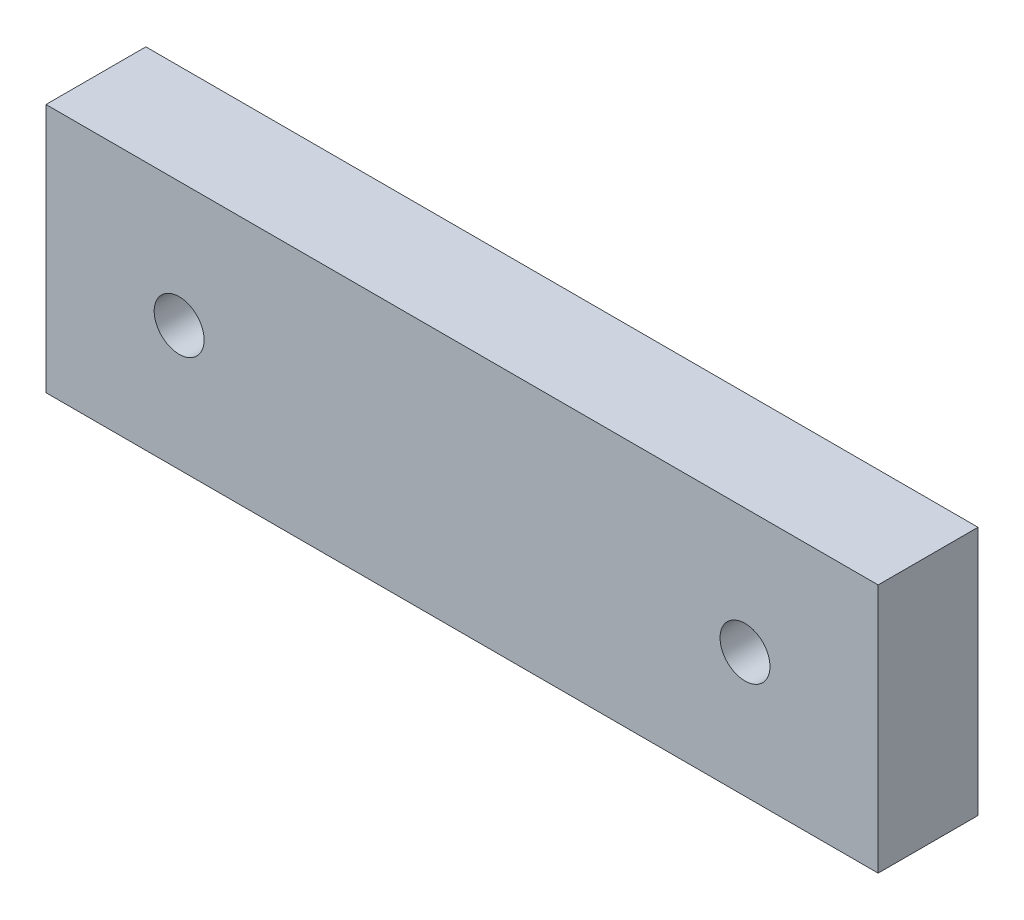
ISO-10303-21;
HEADER;
FILE_DESCRIPTION(('STEP AP214'),'2;1');
FILE_NAME('part.step','',(''),(''),'','','');
FILE_SCHEMA(('AUTOMOTIVE_DESIGN { 1 0 10303 214 1 1 1 1 }'));
ENDSEC;
DATA;
#1=APPLICATION_CONTEXT('core data for automotive mechanical design processes');
#2=APPLICATION_PROTOCOL_DEFINITION('international standard','automotive_design',2000,#1);
#3=PRODUCT_CONTEXT('',#1,'mechanical');
#4=PRODUCT('Part','Part','',(#3));
#5=PRODUCT_RELATED_PRODUCT_CATEGORY('part','',(#4));
#6=PRODUCT_DEFINITION_FORMATION('','',#4);
#7=PRODUCT_DEFINITION_CONTEXT('part definition',#1,'design');
#8=PRODUCT_DEFINITION('design','',#6,#7);
#9=PRODUCT_DEFINITION_SHAPE('','',#8);
#10=(LENGTH_UNIT() NAMED_UNIT(*) SI_UNIT(.MILLI.,.METRE.));
#11=(NAMED_UNIT(*) PLANE_ANGLE_UNIT() SI_UNIT($,.RADIAN.));
#12=(NAMED_UNIT(*) SI_UNIT($,.STERADIAN.) SOLID_ANGLE_UNIT());
#13=UNCERTAINTY_MEASURE_WITH_UNIT(LENGTH_MEASURE(1.E-05),#10,'distance_accuracy_value','');
#14=(GEOMETRIC_REPRESENTATION_CONTEXT(3) GLOBAL_UNCERTAINTY_ASSIGNED_CONTEXT((#13)) GLOBAL_UNIT_ASSIGNED_CONTEXT((#10,
#11,#12)) REPRESENTATION_CONTEXT('',''));
#15=CARTESIAN_POINT('',(0.,0.,0.));
#16=DIRECTION('',(0.,0.,1.));
#17=DIRECTION('',(1.,0.,0.));
#18=AXIS2_PLACEMENT_3D('',#15,#16,#17);
#19=CARTESIAN_POINT('',(0.,15.,6.));
#20=DIRECTION('',(0.,0.,-1.));
#21=DIRECTION('',(-1.,0.,0.));
#22=AXIS2_PLACEMENT_3D('',#19,#20,#21);
#23=PLANE('',#22);
#24=CARTESIAN_POINT('',(8.,7.5,6.));
#25=DIRECTION('',(0.,0.,1.));
#26=DIRECTION('',(1.,0.,0.));
#27=AXIS2_PLACEMENT_3D('',#24,#25,#26);
#28=CIRCLE('',#27,1.5);
#29=CARTESIAN_POINT('',(9.5,7.5,6.));
#30=VERTEX_POINT('',#29);
#31=EDGE_CURVE('E97',#30,#30,#28,.T.);
#32=ORIENTED_EDGE('',*,*,#31,.F.);
#33=EDGE_LOOP('',(#32));
#34=FACE_BOUND('',#33,.T.);
#35=DIRECTION('',(0.,-1.,0.));
#36=VECTOR('',#35,1.);
#37=CARTESIAN_POINT('',(0.,0.,6.));
#38=LINE('',#37,#36);
#39=CARTESIAN_POINT('',(0.,15.,6.));
#40=VERTEX_POINT('',#39);
#41=CARTESIAN_POINT('',(0.,0.,6.));
#42=VERTEX_POINT('',#41);
#43=EDGE_CURVE('E82',#40,#42,#38,.T.);
#44=ORIENTED_EDGE('',*,*,#43,.T.);
#45=DIRECTION('',(1.,0.,0.));
#46=VECTOR('',#45,1.);
#47=CARTESIAN_POINT('',(0.,0.,6.));
#48=LINE('',#47,#46);
#49=CARTESIAN_POINT('',(50.,0.,6.));
#50=VERTEX_POINT('',#49);
#51=EDGE_CURVE('E77',#42,#50,#48,.T.);
#52=ORIENTED_EDGE('',*,*,#51,.T.);
#53=DIRECTION('',(0.,1.,0.));
#54=VECTOR('',#53,1.);
#55=CARTESIAN_POINT('',(50.,0.,6.));
#56=LINE('',#55,#54);
#57=CARTESIAN_POINT('',(50.,15.,6.));
#58=VERTEX_POINT('',#57);
#59=EDGE_CURVE('E80',#50,#58,#56,.T.);
#60=ORIENTED_EDGE('',*,*,#59,.T.);
#61=DIRECTION('',(-1.,0.,0.));
#62=VECTOR('',#61,1.);
#63=CARTESIAN_POINT('',(0.,15.,6.));
#64=LINE('',#63,#62);
#65=EDGE_CURVE('E47',#58,#40,#64,.T.);
#66=ORIENTED_EDGE('',*,*,#65,.T.);
#67=EDGE_LOOP('',(#44,#52,#60,#66));
#68=FACE_BOUND('',#67,.T.);
#69=CARTESIAN_POINT('',(42.,7.5,6.));
#70=DIRECTION('',(0.,0.,1.));
#71=DIRECTION('',(1.,0.,0.));
#72=AXIS2_PLACEMENT_3D('',#69,#70,#71);
#73=CIRCLE('',#72,1.5);
#74=CARTESIAN_POINT('',(43.5,7.5,6.));
#75=VERTEX_POINT('',#74);
#76=EDGE_CURVE('E112',#75,#75,#73,.T.);
#77=ORIENTED_EDGE('',*,*,#76,.F.);
#78=EDGE_LOOP('',(#77));
#79=FACE_BOUND('',#78,.T.);
#80=ADVANCED_FACE('F30',(#34,#68,#79),#23,.F.);
#81=CARTESIAN_POINT('',(0.,15.,0.));
#82=DIRECTION('',(0.,0.,-1.));
#83=DIRECTION('',(-1.,0.,0.));
#84=AXIS2_PLACEMENT_3D('',#81,#82,#83);
#85=PLANE('',#84);
#86=CARTESIAN_POINT('',(8.,7.5,0.));
#87=DIRECTION('',(0.,0.,1.));
#88=DIRECTION('',(1.,0.,0.));
#89=AXIS2_PLACEMENT_3D('',#86,#87,#88);
#90=CIRCLE('',#89,1.5);
#91=CARTESIAN_POINT('',(9.5,7.5,0.));
#92=VERTEX_POINT('',#91);
#93=EDGE_CURVE('E109',#92,#92,#90,.T.);
#94=ORIENTED_EDGE('',*,*,#93,.T.);
#95=EDGE_LOOP('',(#94));
#96=FACE_BOUND('',#95,.T.);
#97=DIRECTION('',(0.,-1.,0.));
#98=VECTOR('',#97,1.);
#99=CARTESIAN_POINT('',(0.,0.,0.));
#100=LINE('',#99,#98);
#101=CARTESIAN_POINT('',(0.,15.,0.));
#102=VERTEX_POINT('',#101);
#103=CARTESIAN_POINT('',(0.,0.,0.));
#104=VERTEX_POINT('',#103);
#105=EDGE_CURVE('E94',#102,#104,#100,.T.);
#106=ORIENTED_EDGE('',*,*,#105,.F.);
#107=DIRECTION('',(-1.,0.,0.));
#108=VECTOR('',#107,1.);
#109=CARTESIAN_POINT('',(0.,15.,0.));
#110=LINE('',#109,#108);
#111=CARTESIAN_POINT('',(50.,15.,0.));
#112=VERTEX_POINT('',#111);
#113=EDGE_CURVE('E70',#112,#102,#110,.T.);
#114=ORIENTED_EDGE('',*,*,#113,.F.);
#115=DIRECTION('',(0.,1.,0.));
#116=VECTOR('',#115,1.);
#117=CARTESIAN_POINT('',(50.,0.,0.));
#118=LINE('',#117,#116);
#119=CARTESIAN_POINT('',(50.,0.,0.));
#120=VERTEX_POINT('',#119);
#121=EDGE_CURVE('E64',#120,#112,#118,.T.);
#122=ORIENTED_EDGE('',*,*,#121,.F.);
#123=DIRECTION('',(1.,0.,0.));
#124=VECTOR('',#123,1.);
#125=CARTESIAN_POINT('',(0.,0.,0.));
#126=LINE('',#125,#124);
#127=EDGE_CURVE('E86',#104,#120,#126,.T.);
#128=ORIENTED_EDGE('',*,*,#127,.F.);
#129=EDGE_LOOP('',(#106,#114,#122,#128));
#130=FACE_BOUND('',#129,.T.);
#131=CARTESIAN_POINT('',(42.,7.5,0.));
#132=DIRECTION('',(0.,0.,1.));
#133=DIRECTION('',(1.,0.,0.));
#134=AXIS2_PLACEMENT_3D('',#131,#132,#133);
#135=CIRCLE('',#134,1.5);
#136=CARTESIAN_POINT('',(43.5,7.5,0.));
#137=VERTEX_POINT('',#136);
#138=EDGE_CURVE('E115',#137,#137,#135,.T.);
#139=ORIENTED_EDGE('',*,*,#138,.T.);
#140=EDGE_LOOP('',(#139));
#141=FACE_BOUND('',#140,.T.);
#142=ADVANCED_FACE('F105',(#96,#130,#141),#85,.T.);
#143=CARTESIAN_POINT('',(0.,0.,6.));
#144=DIRECTION('',(1.,0.,0.));
#145=DIRECTION('',(0.,0.,-1.));
#146=AXIS2_PLACEMENT_3D('',#143,#144,#145);
#147=PLANE('',#146);
#148=ORIENTED_EDGE('',*,*,#105,.T.);
#149=DIRECTION('',(0.,0.,-1.));
#150=VECTOR('',#149,1.);
#151=CARTESIAN_POINT('',(0.,0.,6.));
#152=LINE('',#151,#150);
#153=EDGE_CURVE('E11',#42,#104,#152,.T.);
#154=ORIENTED_EDGE('',*,*,#153,.F.);
#155=ORIENTED_EDGE('',*,*,#43,.F.);
#156=DIRECTION('',(0.,0.,-1.));
#157=VECTOR('',#156,1.);
#158=CARTESIAN_POINT('',(0.,15.,6.));
#159=LINE('',#158,#157);
#160=EDGE_CURVE('E90',#40,#102,#159,.T.);
#161=ORIENTED_EDGE('',*,*,#160,.T.);
#162=EDGE_LOOP('',(#148,#154,#155,#161));
#163=FACE_BOUND('',#162,.T.);
#164=ADVANCED_FACE('F32',(#163),#147,.F.);
#165=CARTESIAN_POINT('',(0.,0.,6.));
#166=DIRECTION('',(0.,1.,0.));
#167=DIRECTION('',(0.,0.,1.));
#168=AXIS2_PLACEMENT_3D('',#165,#166,#167);
#169=PLANE('',#168);
#170=ORIENTED_EDGE('',*,*,#127,.T.);
#171=DIRECTION('',(0.,0.,-1.));
#172=VECTOR('',#171,1.);
#173=CARTESIAN_POINT('',(50.,0.,6.));
#174=LINE('',#173,#172);
#175=EDGE_CURVE('E39',#50,#120,#174,.T.);
#176=ORIENTED_EDGE('',*,*,#175,.F.);
#177=ORIENTED_EDGE('',*,*,#51,.F.);
#178=ORIENTED_EDGE('',*,*,#153,.T.);
#179=EDGE_LOOP('',(#170,#176,#177,#178));
#180=FACE_BOUND('',#179,.T.);
#181=ADVANCED_FACE('F85',(#180),#169,.F.);
#182=CARTESIAN_POINT('',(50.,0.,6.));
#183=DIRECTION('',(-1.,0.,0.));
#184=DIRECTION('',(0.,0.,1.));
#185=AXIS2_PLACEMENT_3D('',#182,#183,#184);
#186=PLANE('',#185);
#187=ORIENTED_EDGE('',*,*,#121,.T.);
#188=DIRECTION('',(0.,0.,-1.));
#189=VECTOR('',#188,1.);
#190=CARTESIAN_POINT('',(50.,15.,6.));
#191=LINE('',#190,#189);
#192=EDGE_CURVE('E87',#58,#112,#191,.T.);
#193=ORIENTED_EDGE('',*,*,#192,.F.);
#194=ORIENTED_EDGE('',*,*,#59,.F.);
#195=ORIENTED_EDGE('',*,*,#175,.T.);
#196=EDGE_LOOP('',(#187,#193,#194,#195));
#197=FACE_BOUND('',#196,.T.);
#198=ADVANCED_FACE('F88',(#197),#186,.F.);
#199=CARTESIAN_POINT('',(0.,15.,6.));
#200=DIRECTION('',(0.,-1.,0.));
#201=DIRECTION('',(0.,0.,-1.));
#202=AXIS2_PLACEMENT_3D('',#199,#200,#201);
#203=PLANE('',#202);
#204=ORIENTED_EDGE('',*,*,#113,.T.);
#205=ORIENTED_EDGE('',*,*,#160,.F.);
#206=ORIENTED_EDGE('',*,*,#65,.F.);
#207=ORIENTED_EDGE('',*,*,#192,.T.);
#208=EDGE_LOOP('',(#204,#205,#206,#207));
#209=FACE_BOUND('',#208,.T.);
#210=ADVANCED_FACE('F102',(#209),#203,.F.);
#211=CARTESIAN_POINT('',(8.,7.5,6.));
#212=DIRECTION('',(0.,0.,-1.));
#213=DIRECTION('',(-1.,0.,0.));
#214=AXIS2_PLACEMENT_3D('',#211,#212,#213);
#215=CYLINDRICAL_SURFACE('',#214,1.5);
#216=ORIENTED_EDGE('',*,*,#31,.T.);
#217=EDGE_LOOP('',(#216));
#218=FACE_BOUND('',#217,.T.);
#219=ORIENTED_EDGE('',*,*,#93,.F.);
#220=EDGE_LOOP('',(#219));
#221=FACE_BOUND('',#220,.T.);
#222=ADVANCED_FACE('F133',(#218,#221),#215,.F.);
#223=CARTESIAN_POINT('',(42.,7.5,6.));
#224=DIRECTION('',(0.,0.,-1.));
#225=DIRECTION('',(-1.,0.,0.));
#226=AXIS2_PLACEMENT_3D('',#223,#224,#225);
#227=CYLINDRICAL_SURFACE('',#226,1.5);
#228=ORIENTED_EDGE('',*,*,#76,.T.);
#229=EDGE_LOOP('',(#228));
#230=FACE_BOUND('',#229,.T.);
#231=ORIENTED_EDGE('',*,*,#138,.F.);
#232=EDGE_LOOP('',(#231));
#233=FACE_BOUND('',#232,.T.);
#234=ADVANCED_FACE('F121',(#230,#233),#227,.F.);
#235=CLOSED_SHELL('',(#80,#142,#164,#181,#198,#210,#222,#234));
#236=MANIFOLD_SOLID_BREP('B2',#235);
#237=ADVANCED_BREP_SHAPE_REPRESENTATION('',(#18,#236),#14);
#238=SHAPE_DEFINITION_REPRESENTATION(#9,#237);
ENDSEC;
END-ISO-10303-21;
